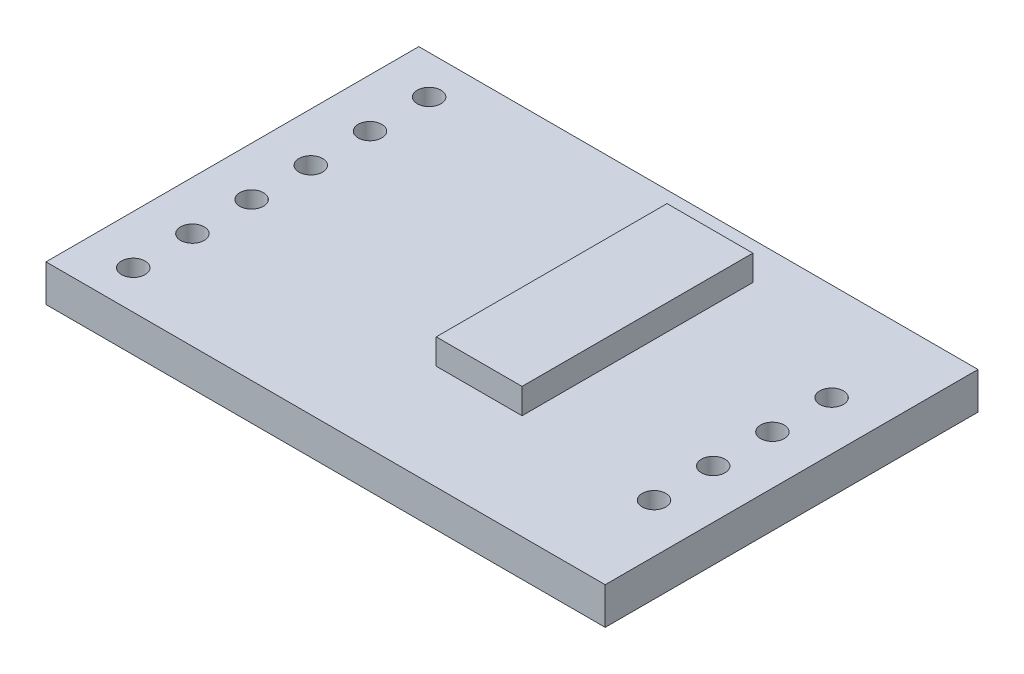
from build123d import *

# Parameters (mm, degrees)
SKETCH1_W           = 24
SKETCH1_H           = 16
SKETCH1_R           = 0.508
BOSS_EXTRUDE1_DEPTH = 1.5875
SKETCH2_W           = 3.683
SKETCH2_H           = 9.906
BOSS_EXTRUDE2_DEPTH = 1.0922


with BuildPart() as part:
    # Sketch1 → Boss-Extrude1 (new body)
    with BuildSketch(Plane(origin=(0, 0, 0), x_dir=(1, 0, 0), z_dir=(0, 1, 0))):
        Rectangle(SKETCH1_W, SKETCH1_H)
        with Locations(Location((-9.906, -6.35, 0), (0, 0, 270))):
            Circle(SKETCH1_R, mode=Mode.SUBTRACT)
        with Locations(Location((9.906, -3.81, 0), (0, 0, 270))):
            Circle(SKETCH1_R, mode=Mode.SUBTRACT)
        with Locations(Location((9.906, -1.27, 0), (0, 0, 270))):
            Circle(SKETCH1_R, mode=Mode.SUBTRACT)
        with Locations(Location((9.906, 1.27, 0), (0, 0, 270))):
            Circle(SKETCH1_R, mode=Mode.SUBTRACT)
        with Locations(Location((9.906, 3.81, 0), (0, 0, 270))):
            Circle(SKETCH1_R, mode=Mode.SUBTRACT)
        with Locations(Location((-9.906, -3.81, 0), (0, 0, 270))):
            Circle(SKETCH1_R, mode=Mode.SUBTRACT)
        with Locations(Location((-9.906, -1.27, 0), (0, 0, 270))):
            Circle(SKETCH1_R, mode=Mode.SUBTRACT)
        with Locations(Location((-9.906, 1.27, 0), (0, 0, 270))):
            Circle(SKETCH1_R, mode=Mode.SUBTRACT)
        with Locations(Location((-9.906, 3.81, 0), (0, 0, 270))):
            Circle(SKETCH1_R, mode=Mode.SUBTRACT)
        with Locations(Location((-9.906, 6.35, 0), (0, 0, 270))):
            Circle(SKETCH1_R, mode=Mode.SUBTRACT)
    extrude(amount=BOSS_EXTRUDE1_DEPTH)


with BuildPart() as body_2:
    # Sketch2 → Boss-Extrude2 (new body)
    with BuildSketch(Plane(origin=(0, 1.5875, 0), x_dir=(1, 0, 0), z_dir=(0, 1, 0))):
        with Locations((2.0955, 1.4468)):
            Rectangle(SKETCH2_W, SKETCH2_H)
    extrude(amount=BOSS_EXTRUDE2_DEPTH)


solid = Compound([part.part, body_2.part])
